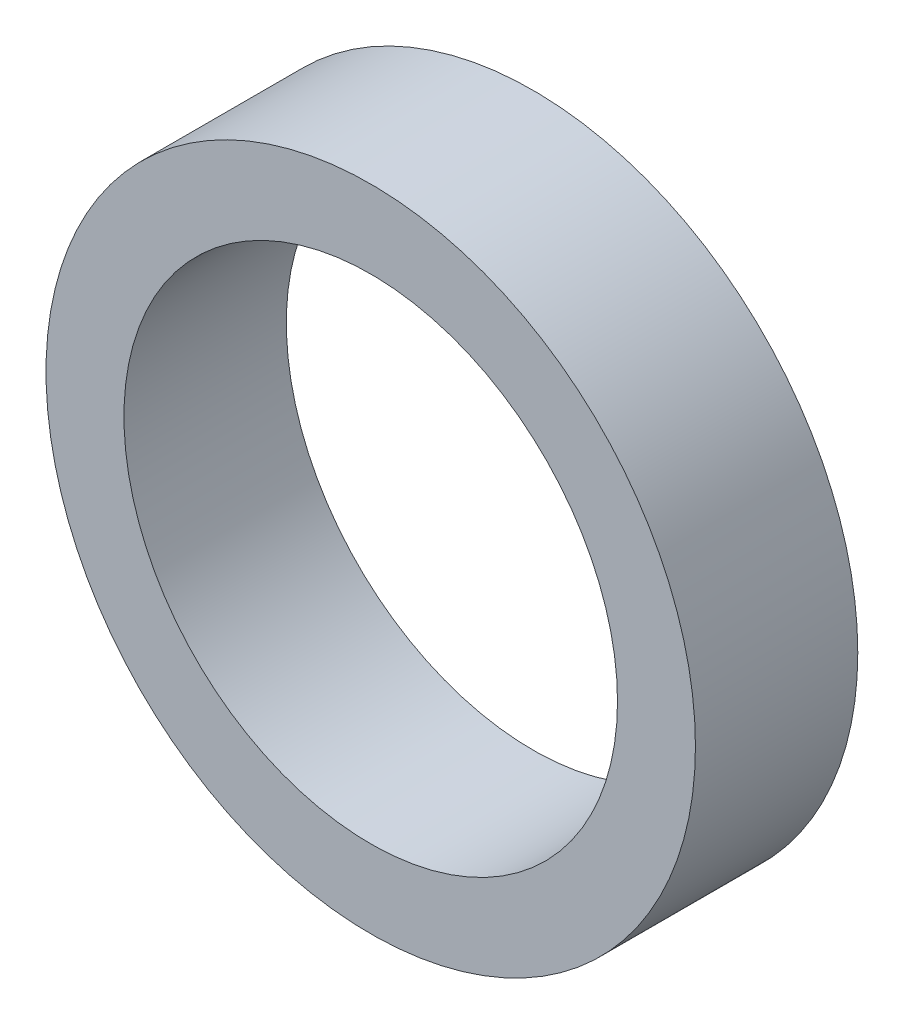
ISO-10303-21;
HEADER;
FILE_DESCRIPTION(('STEP AP214'),'2;1');
FILE_NAME('part.step','',(''),(''),'','','');
FILE_SCHEMA(('AUTOMOTIVE_DESIGN { 1 0 10303 214 1 1 1 1 }'));
ENDSEC;
DATA;
#1=APPLICATION_CONTEXT('core data for automotive mechanical design processes');
#2=APPLICATION_PROTOCOL_DEFINITION('international standard','automotive_design',2000,#1);
#3=PRODUCT_CONTEXT('',#1,'mechanical');
#4=PRODUCT('Part','Part','',(#3));
#5=PRODUCT_RELATED_PRODUCT_CATEGORY('part','',(#4));
#6=PRODUCT_DEFINITION_FORMATION('','',#4);
#7=PRODUCT_DEFINITION_CONTEXT('part definition',#1,'design');
#8=PRODUCT_DEFINITION('design','',#6,#7);
#9=PRODUCT_DEFINITION_SHAPE('','',#8);
#10=(LENGTH_UNIT() NAMED_UNIT(*) SI_UNIT(.MILLI.,.METRE.));
#11=(NAMED_UNIT(*) PLANE_ANGLE_UNIT() SI_UNIT($,.RADIAN.));
#12=(NAMED_UNIT(*) SI_UNIT($,.STERADIAN.) SOLID_ANGLE_UNIT());
#13=UNCERTAINTY_MEASURE_WITH_UNIT(LENGTH_MEASURE(1.E-05),#10,'distance_accuracy_value','');
#14=(GEOMETRIC_REPRESENTATION_CONTEXT(3) GLOBAL_UNCERTAINTY_ASSIGNED_CONTEXT((#13)) GLOBAL_UNIT_ASSIGNED_CONTEXT((#10,
#11,#12)) REPRESENTATION_CONTEXT('',''));
#15=CARTESIAN_POINT('',(0.,0.,0.));
#16=DIRECTION('',(0.,0.,1.));
#17=DIRECTION('',(1.,0.,0.));
#18=AXIS2_PLACEMENT_3D('',#15,#16,#17);
#19=CARTESIAN_POINT('',(1.0547118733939E-12,0.,5.00000000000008));
#20=DIRECTION('',(0.,0.,1.));
#21=DIRECTION('',(1.,0.,0.));
#22=AXIS2_PLACEMENT_3D('',#19,#20,#21);
#23=PLANE('',#22);
#24=CARTESIAN_POINT('',(1.0547118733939E-12,0.,5.00000000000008));
#25=DIRECTION('',(0.,0.,1.));
#26=DIRECTION('',(1.,0.,0.));
#27=AXIS2_PLACEMENT_3D('',#24,#25,#26);
#28=CIRCLE('',#27,10.);
#29=CARTESIAN_POINT('',(10.0000000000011,0.,5.00000000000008));
#30=VERTEX_POINT('',#29);
#31=EDGE_CURVE('E10',#30,#30,#28,.T.);
#32=ORIENTED_EDGE('',*,*,#31,.T.);
#33=EDGE_LOOP('',(#32));
#34=FACE_BOUND('',#33,.T.);
#35=CARTESIAN_POINT('',(1.0547118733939E-12,0.,5.00000000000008));
#36=DIRECTION('',(0.,0.,1.));
#37=DIRECTION('',(1.,0.,0.));
#38=AXIS2_PLACEMENT_3D('',#35,#36,#37);
#39=CIRCLE('',#38,7.6);
#40=CARTESIAN_POINT('',(7.60000000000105,0.,5.00000000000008));
#41=VERTEX_POINT('',#40);
#42=EDGE_CURVE('E54',#41,#41,#39,.T.);
#43=ORIENTED_EDGE('',*,*,#42,.F.);
#44=EDGE_LOOP('',(#43));
#45=FACE_BOUND('',#44,.T.);
#46=ADVANCED_FACE('F40',(#34,#45),#23,.T.);
#47=CARTESIAN_POINT('',(1.0547118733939E-12,0.,0.));
#48=DIRECTION('',(0.,0.,1.));
#49=DIRECTION('',(1.,0.,0.));
#50=AXIS2_PLACEMENT_3D('',#47,#48,#49);
#51=PLANE('',#50);
#52=CARTESIAN_POINT('',(1.0547118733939E-12,0.,0.));
#53=DIRECTION('',(0.,0.,1.));
#54=DIRECTION('',(1.,0.,0.));
#55=AXIS2_PLACEMENT_3D('',#52,#53,#54);
#56=CIRCLE('',#55,10.);
#57=CARTESIAN_POINT('',(10.0000000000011,0.,0.));
#58=VERTEX_POINT('',#57);
#59=EDGE_CURVE('E44',#58,#58,#56,.T.);
#60=ORIENTED_EDGE('',*,*,#59,.F.);
#61=EDGE_LOOP('',(#60));
#62=FACE_BOUND('',#61,.T.);
#63=CARTESIAN_POINT('',(1.0547118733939E-12,0.,0.));
#64=DIRECTION('',(0.,0.,1.));
#65=DIRECTION('',(1.,0.,0.));
#66=AXIS2_PLACEMENT_3D('',#63,#64,#65);
#67=CIRCLE('',#66,7.6);
#68=CARTESIAN_POINT('',(7.60000000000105,0.,0.));
#69=VERTEX_POINT('',#68);
#70=EDGE_CURVE('E56',#69,#69,#67,.T.);
#71=ORIENTED_EDGE('',*,*,#70,.T.);
#72=EDGE_LOOP('',(#71));
#73=FACE_BOUND('',#72,.T.);
#74=ADVANCED_FACE('F67',(#62,#73),#51,.F.);
#75=CARTESIAN_POINT('',(1.0547118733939E-12,0.,5.00000000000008));
#76=DIRECTION('',(0.,0.,-1.));
#77=DIRECTION('',(-1.,0.,0.));
#78=AXIS2_PLACEMENT_3D('',#75,#76,#77);
#79=CYLINDRICAL_SURFACE('',#78,10.);
#80=ORIENTED_EDGE('',*,*,#31,.F.);
#81=EDGE_LOOP('',(#80));
#82=FACE_BOUND('',#81,.T.);
#83=ORIENTED_EDGE('',*,*,#59,.T.);
#84=EDGE_LOOP('',(#83));
#85=FACE_BOUND('',#84,.T.);
#86=ADVANCED_FACE('F42',(#82,#85),#79,.T.);
#87=CARTESIAN_POINT('',(1.0547118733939E-12,0.,5.00000000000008));
#88=DIRECTION('',(0.,0.,-1.));
#89=DIRECTION('',(-1.,0.,0.));
#90=AXIS2_PLACEMENT_3D('',#87,#88,#89);
#91=CYLINDRICAL_SURFACE('',#90,7.6);
#92=ORIENTED_EDGE('',*,*,#42,.T.);
#93=EDGE_LOOP('',(#92));
#94=FACE_BOUND('',#93,.T.);
#95=ORIENTED_EDGE('',*,*,#70,.F.);
#96=EDGE_LOOP('',(#95));
#97=FACE_BOUND('',#96,.T.);
#98=ADVANCED_FACE('F63',(#94,#97),#91,.F.);
#99=CLOSED_SHELL('',(#46,#74,#86,#98));
#100=MANIFOLD_SOLID_BREP('B2',#99);
#101=ADVANCED_BREP_SHAPE_REPRESENTATION('',(#18,#100),#14);
#102=SHAPE_DEFINITION_REPRESENTATION(#9,#101);
ENDSEC;
END-ISO-10303-21;
